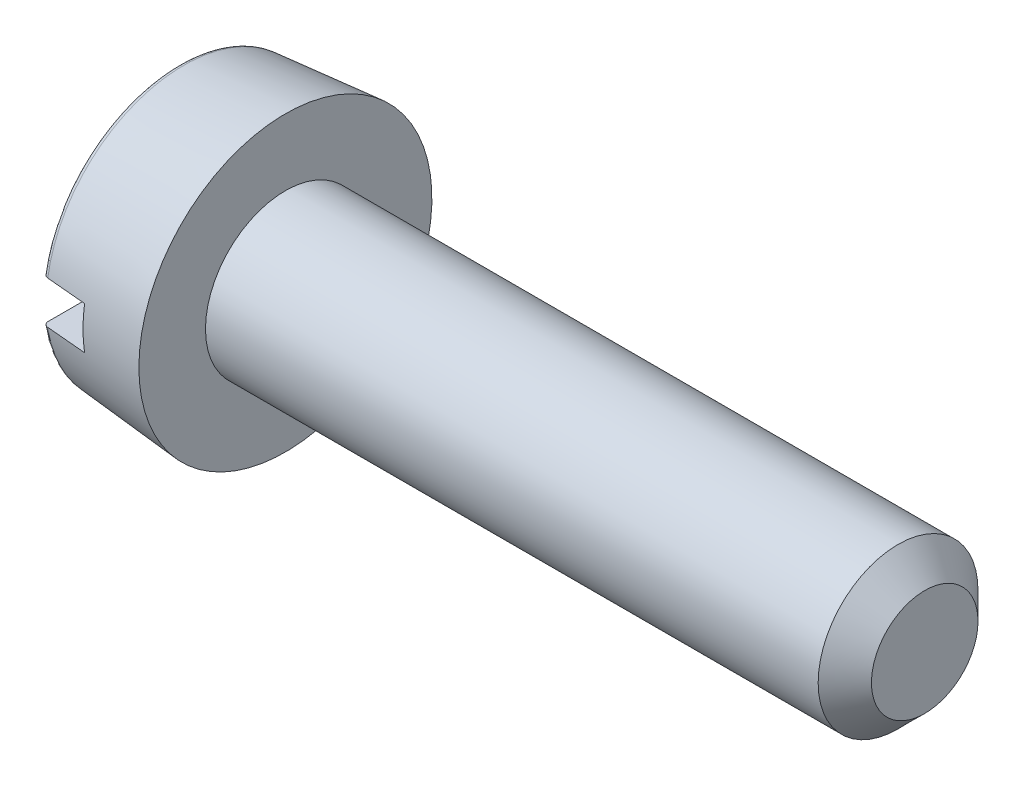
ISO-10303-21;
HEADER;
FILE_DESCRIPTION(('STEP AP214'),'2;1');
FILE_NAME('part.step','',(''),(''),'','','');
FILE_SCHEMA(('AUTOMOTIVE_DESIGN { 1 0 10303 214 1 1 1 1 }'));
ENDSEC;
DATA;
#1=APPLICATION_CONTEXT('core data for automotive mechanical design processes');
#2=APPLICATION_PROTOCOL_DEFINITION('international standard','automotive_design',2000,#1);
#3=PRODUCT_CONTEXT('',#1,'mechanical');
#4=PRODUCT('Part','Part','',(#3));
#5=PRODUCT_RELATED_PRODUCT_CATEGORY('part','',(#4));
#6=PRODUCT_DEFINITION_FORMATION('','',#4);
#7=PRODUCT_DEFINITION_CONTEXT('part definition',#1,'design');
#8=PRODUCT_DEFINITION('design','',#6,#7);
#9=PRODUCT_DEFINITION_SHAPE('','',#8);
#10=(LENGTH_UNIT() NAMED_UNIT(*) SI_UNIT(.MILLI.,.METRE.));
#11=(NAMED_UNIT(*) PLANE_ANGLE_UNIT() SI_UNIT($,.RADIAN.));
#12=(NAMED_UNIT(*) SI_UNIT($,.STERADIAN.) SOLID_ANGLE_UNIT());
#13=UNCERTAINTY_MEASURE_WITH_UNIT(LENGTH_MEASURE(1.E-05),#10,'distance_accuracy_value','');
#14=(GEOMETRIC_REPRESENTATION_CONTEXT(3) GLOBAL_UNCERTAINTY_ASSIGNED_CONTEXT((#13)) GLOBAL_UNIT_ASSIGNED_CONTEXT((#10,
#11,#12)) REPRESENTATION_CONTEXT('',''));
#15=CARTESIAN_POINT('',(0.,0.,0.));
#16=DIRECTION('',(0.,0.,1.));
#17=DIRECTION('',(1.,0.,0.));
#18=AXIS2_PLACEMENT_3D('',#15,#16,#17);
#19=CARTESIAN_POINT('',(0.,0.,0.));
#20=DIRECTION('',(-1.,0.,0.));
#21=DIRECTION('',(0.,0.,1.));
#22=AXIS2_PLACEMENT_3D('',#19,#20,#21);
#23=PLANE('',#22);
#24=DIRECTION('',(0.,0.,-1.));
#25=VECTOR('',#24,1.);
#26=CARTESIAN_POINT('',(0.,0.399999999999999,2.75));
#27=LINE('',#26,#25);
#28=CARTESIAN_POINT('',(0.,0.399999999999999,2.45096382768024));
#29=VERTEX_POINT('',#28);
#30=CARTESIAN_POINT('',(0.,0.399999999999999,-2.45096382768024));
#31=VERTEX_POINT('',#30);
#32=EDGE_CURVE('E105',#29,#31,#27,.T.);
#33=ORIENTED_EDGE('',*,*,#32,.F.);
#34=CARTESIAN_POINT('',(0.,0.,0.));
#35=DIRECTION('',(-1.,0.,0.));
#36=DIRECTION('',(0.,0.,1.));
#37=AXIS2_PLACEMENT_3D('',#34,#35,#36);
#38=CIRCLE('',#37,2.48338955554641);
#39=EDGE_CURVE('E108',#29,#31,#38,.T.);
#40=ORIENTED_EDGE('',*,*,#39,.T.);
#41=EDGE_LOOP('',(#33,#40));
#42=FACE_BOUND('',#41,.T.);
#43=ADVANCED_FACE('F37',(#42),#23,.T.);
#44=CARTESIAN_POINT('',(0.1,0.,0.));
#45=DIRECTION('',(-1.,0.,0.));
#46=DIRECTION('',(0.,0.,1.));
#47=AXIS2_PLACEMENT_3D('',#44,#45,#46);
#48=TOROIDAL_SURFACE('',#47,2.48338955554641,0.1);
#49=CARTESIAN_POINT('',(0.0485751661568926,0.399999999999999,-2.53782400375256));
#50=CARTESIAN_POINT('',(0.0533355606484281,0.399999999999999,-2.54071333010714));
#51=CARTESIAN_POINT('',(0.0583417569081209,0.399999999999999,-2.5432050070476));
#52=CARTESIAN_POINT('',(0.0687050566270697,0.399999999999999,-2.54731542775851));
#53=CARTESIAN_POINT('',(0.0740625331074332,0.399999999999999,-2.54893322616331));
#54=CARTESIAN_POINT('',(0.0849727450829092,0.399999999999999,-2.55124400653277));
#55=CARTESIAN_POINT('',(0.0905254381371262,0.399999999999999,-2.55193718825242));
#56=CARTESIAN_POINT('',(0.101666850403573,0.399999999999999,-2.55237774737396));
#57=CARTESIAN_POINT('',(0.107255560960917,0.399999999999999,-2.55212534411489));
#58=CARTESIAN_POINT('',(0.118292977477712,0.399999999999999,-2.55068537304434));
#59=CARTESIAN_POINT('',(0.123742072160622,0.399999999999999,-2.54950078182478));
#60=CARTESIAN_POINT('',(0.134364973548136,0.399999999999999,-2.54623584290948));
#61=CARTESIAN_POINT('',(0.139538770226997,0.399999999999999,-2.54415546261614));
#62=CARTESIAN_POINT('',(0.149479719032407,0.399999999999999,-2.53915450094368));
#63=CARTESIAN_POINT('',(0.1542457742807,0.399999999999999,-2.5362317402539));
#64=CARTESIAN_POINT('',(0.163225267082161,0.399999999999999,-2.52963434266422));
#65=CARTESIAN_POINT('',(0.167438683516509,0.399999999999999,-2.52595967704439));
#66=CARTESIAN_POINT('',(0.175235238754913,0.399999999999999,-2.51792797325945));
#67=CARTESIAN_POINT('',(0.178812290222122,0.399999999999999,-2.51356502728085));
#68=CARTESIAN_POINT('',(0.185193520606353,0.399999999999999,-2.50430657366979));
#69=CARTESIAN_POINT('',(0.187997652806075,0.399999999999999,-2.49941103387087));
#70=CARTESIAN_POINT('',(0.192789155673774,0.399999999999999,-2.48916309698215));
#71=CARTESIAN_POINT('',(0.194766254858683,0.399999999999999,-2.48380589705));
#72=CARTESIAN_POINT('',(0.197803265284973,0.399999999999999,-2.47283752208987));
#73=CARTESIAN_POINT('',(0.198863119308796,0.399999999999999,-2.46722633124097));
#74=CARTESIAN_POINT('',(0.200044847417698,0.399999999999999,-2.45584788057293));
#75=CARTESIAN_POINT('',(0.200157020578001,0.399999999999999,-2.45007961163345));
#76=CARTESIAN_POINT('',(0.199415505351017,0.399999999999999,-2.43860536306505));
#77=CARTESIAN_POINT('',(0.198561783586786,0.399999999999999,-2.43289938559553));
#78=CARTESIAN_POINT('',(0.195905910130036,0.399999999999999,-2.42168897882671));
#79=CARTESIAN_POINT('',(0.194100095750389,0.399999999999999,-2.41618541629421));
#80=CARTESIAN_POINT('',(0.189585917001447,0.399999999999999,-2.40556157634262));
#81=CARTESIAN_POINT('',(0.186877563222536,0.399999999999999,-2.40044129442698));
#82=CARTESIAN_POINT('',(0.180646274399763,0.399999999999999,-2.39075689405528));
#83=CARTESIAN_POINT('',(0.177127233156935,0.399999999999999,-2.38619027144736));
#84=CARTESIAN_POINT('',(0.16936410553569,0.399999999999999,-2.37772142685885));
#85=CARTESIAN_POINT('',(0.165120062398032,0.399999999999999,-2.37381916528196));
#86=CARTESIAN_POINT('',(0.15607995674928,0.399999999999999,-2.36683969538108));
#87=CARTESIAN_POINT('',(0.151290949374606,0.399999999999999,-2.36375335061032));
#88=CARTESIAN_POINT('',(0.14125723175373,0.399999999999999,-2.35844131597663));
#89=CARTESIAN_POINT('',(0.136012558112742,0.399999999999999,-2.35621555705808));
#90=CARTESIAN_POINT('',(0.125292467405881,0.399999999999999,-2.35271848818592));
#91=CARTESIAN_POINT('',(0.119821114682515,0.399999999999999,-2.35143471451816));
#92=CARTESIAN_POINT('',(0.10874007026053,0.399999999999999,-2.3498129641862));
#93=CARTESIAN_POINT('',(0.103130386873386,0.399999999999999,-2.34947493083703));
#94=CARTESIAN_POINT('',(0.0919839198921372,0.399999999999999,-2.34975394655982));
#95=CARTESIAN_POINT('',(0.0864469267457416,0.399999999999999,-2.3503627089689));
#96=CARTESIAN_POINT('',(0.0755538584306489,0.399999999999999,-2.35250103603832));
#97=CARTESIAN_POINT('',(0.0701977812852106,0.399999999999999,-2.35403059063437));
#98=CARTESIAN_POINT('',(0.0598152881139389,0.399999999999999,-2.35796437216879));
#99=CARTESIAN_POINT('',(0.0547889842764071,0.399999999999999,-2.36036889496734));
#100=CARTESIAN_POINT('',(0.0452064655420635,0.399999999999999,-2.36598034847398));
#101=CARTESIAN_POINT('',(0.040650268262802,0.399999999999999,-2.36918730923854));
#102=CARTESIAN_POINT('',(0.032091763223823,0.399999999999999,-2.37634229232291));
#103=CARTESIAN_POINT('',(0.0280948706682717,0.399999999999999,-2.38029679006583));
#104=CARTESIAN_POINT('',(0.0208109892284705,0.399999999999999,-2.3888128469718));
#105=CARTESIAN_POINT('',(0.0175240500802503,0.399999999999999,-2.39337444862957));
#106=CARTESIAN_POINT('',(0.0117067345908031,0.399999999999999,-2.4030406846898));
#107=CARTESIAN_POINT('',(0.00918709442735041,0.399999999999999,-2.40815178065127));
#108=CARTESIAN_POINT('',(0.00503040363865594,0.399999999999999,-2.41872109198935));
#109=CARTESIAN_POINT('',(0.00339341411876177,0.399999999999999,-2.42417933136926));
#110=CARTESIAN_POINT('',(0.00103079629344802,0.399999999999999,-2.43535569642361));
#111=CARTESIAN_POINT('',(0.000315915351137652,0.399999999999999,-2.44107609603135));
#112=CARTESIAN_POINT('',(-0.000148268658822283,0.399999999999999,-2.45255584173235));
#113=CARTESIAN_POINT('',(0.00010242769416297,0.399999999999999,-2.45831518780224));
#114=CARTESIAN_POINT('',(0.00156672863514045,0.399999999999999,-2.46973701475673));
#115=CARTESIAN_POINT('',(0.00278471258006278,0.399999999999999,-2.47539893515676));
#116=CARTESIAN_POINT('',(0.0061580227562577,0.399999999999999,-2.48643816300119));
#117=CARTESIAN_POINT('',(0.00831357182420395,0.399999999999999,-2.49181540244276));
#118=CARTESIAN_POINT('',(0.0134950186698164,0.399999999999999,-2.50210927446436));
#119=CARTESIAN_POINT('',(0.0165179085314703,0.399999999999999,-2.5070274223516));
#120=CARTESIAN_POINT('',(0.023352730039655,0.399999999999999,-2.51627478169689));
#121=CARTESIAN_POINT('',(0.0271636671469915,0.399999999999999,-2.52060472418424));
#122=CARTESIAN_POINT('',(0.0339390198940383,0.399999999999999,-2.52708853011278));
#123=CARTESIAN_POINT('',(0.0367007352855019,0.399999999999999,-2.52945777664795));
#124=CARTESIAN_POINT('',(0.04246511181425,0.399999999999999,-2.5338824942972));
#125=CARTESIAN_POINT('',(0.0454677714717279,0.399999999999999,-2.53593796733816));
#126=CARTESIAN_POINT('',(0.0485751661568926,0.399999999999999,-2.53782400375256));
#127=B_SPLINE_CURVE_WITH_KNOTS('',3,(#49,#50,#51,#52,#53,#54,#55,#56,#57,#58,#59,#60,#61,#62,
#63,#64,#65,#66,#67,#68,#69,#70,#71,#72,#73,#74,#75,#76,#77,#78,#79,#80,#81,#82,#83,#84,#85,#86,
#87,#88,#89,#90,#91,#92,#93,#94,#95,#96,#97,#98,#99,#100,#101,#102,#103,#104,#105,#106,#107,
#108,#109,#110,#111,#112,#113,#114,#115,#116,#117,#118,#119,#120,#121,#122,#123,#124,#125,#126),
.UNSPECIFIED.,.T.,.F.,(4,2,2,2,2,2,2,2,2,2,2,2,2,2,2,2,2,2,2,2,2,2,2,2,2,2,2,2,2,2,2,2,2,2,2,2,
2,2,4),(0.,0.0166927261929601,0.0334034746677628,0.0501106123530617,0.0668138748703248,
0.0834640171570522,0.100114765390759,0.116808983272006,0.133503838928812,0.150350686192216,
0.167198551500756,0.184249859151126,0.201302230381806,0.21852894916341,0.235756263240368,
0.253050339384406,0.270344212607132,0.287556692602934,0.304768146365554,0.321777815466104,
0.338786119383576,0.355565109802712,0.372343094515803,0.388975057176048,0.405606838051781,
0.422244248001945,0.438882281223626,0.455671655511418,0.472462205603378,0.489477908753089,
0.506494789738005,0.523708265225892,0.54092173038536,0.558213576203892,0.575509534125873,
0.592746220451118,0.609961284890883,0.620857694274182,0.631754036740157),.UNSPECIFIED.);
#128=CARTESIAN_POINT('',(0.0912844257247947,0.399999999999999,-2.55184945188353));
#129=VERTEX_POINT('',#128);
#130=EDGE_CURVE('E60',#31,#129,#127,.T.);
#131=ORIENTED_EDGE('',*,*,#130,.F.);
#132=ORIENTED_EDGE('',*,*,#39,.F.);
#133=CARTESIAN_POINT('',(0.066087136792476,0.399999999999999,2.35559521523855));
#134=CARTESIAN_POINT('',(0.0712950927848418,0.399999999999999,2.35369117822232));
#135=CARTESIAN_POINT('',(0.076666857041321,0.399999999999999,2.35222401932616));
#136=CARTESIAN_POINT('',(0.0875846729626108,0.399999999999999,2.35021144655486));
#137=CARTESIAN_POINT('',(0.0931309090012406,0.399999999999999,2.34966704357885));
#138=CARTESIAN_POINT('',(0.104234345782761,0.399999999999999,2.34951890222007));
#139=CARTESIAN_POINT('',(0.109791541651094,0.399999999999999,2.34991481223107));
#140=CARTESIAN_POINT('',(0.120758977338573,0.399999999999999,2.35163438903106));
#141=CARTESIAN_POINT('',(0.126169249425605,0.399999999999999,2.3529578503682));
#142=CARTESIAN_POINT('',(0.136691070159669,0.399999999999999,2.35649136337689));
#143=CARTESIAN_POINT('',(0.141802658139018,0.399999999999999,2.35870129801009));
#144=CARTESIAN_POINT('',(0.151586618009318,0.399999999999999,2.36394124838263));
#145=CARTESIAN_POINT('',(0.15625896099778,0.399999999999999,2.36697131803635));
#146=CARTESIAN_POINT('',(0.165074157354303,0.399999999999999,2.37379047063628));
#147=CARTESIAN_POINT('',(0.169212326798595,0.399999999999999,2.37758560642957));
#148=CARTESIAN_POINT('',(0.176803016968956,0.399999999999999,2.38580863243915));
#149=CARTESIAN_POINT('',(0.180255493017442,0.399999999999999,2.39023656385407));
#150=CARTESIAN_POINT('',(0.186425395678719,0.399999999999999,2.39966205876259));
#151=CARTESIAN_POINT('',(0.189132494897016,0.399999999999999,2.40466638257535));
#152=CARTESIAN_POINT('',(0.19367967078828,0.399999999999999,2.41505452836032));
#153=CARTESIAN_POINT('',(0.195519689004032,0.399999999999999,2.42043837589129));
#154=CARTESIAN_POINT('',(0.19830186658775,0.399999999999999,2.43150243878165));
#155=CARTESIAN_POINT('',(0.199232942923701,0.399999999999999,2.43718544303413));
#156=CARTESIAN_POINT('',(0.200133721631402,0.399999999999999,2.44862724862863));
#157=CARTESIAN_POINT('',(0.200103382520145,0.399999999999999,2.45438605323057));
#158=CARTESIAN_POINT('',(0.199078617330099,0.399999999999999,2.46584997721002));
#159=CARTESIAN_POINT('',(0.198078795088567,0.399999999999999,2.47155461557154));
#160=CARTESIAN_POINT('',(0.195132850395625,0.399999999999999,2.48271426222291));
#161=CARTESIAN_POINT('',(0.193186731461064,0.399999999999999,2.4881692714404));
#162=CARTESIAN_POINT('',(0.188406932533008,0.399999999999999,2.49865615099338));
#163=CARTESIAN_POINT('',(0.185575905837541,0.399999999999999,2.50368922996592));
#164=CARTESIAN_POINT('',(0.179101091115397,0.399999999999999,2.51320240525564));
#165=CARTESIAN_POINT('',(0.17545734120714,0.399999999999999,2.51768252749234));
#166=CARTESIAN_POINT('',(0.167497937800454,0.399999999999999,2.52591455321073));
#167=CARTESIAN_POINT('',(0.163189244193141,0.399999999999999,2.52967318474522));
#168=CARTESIAN_POINT('',(0.153995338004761,0.399999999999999,2.53640297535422));
#169=CARTESIAN_POINT('',(0.149110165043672,0.399999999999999,2.53937418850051));
#170=CARTESIAN_POINT('',(0.138966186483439,0.399999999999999,2.54440671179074));
#171=CARTESIAN_POINT('',(0.133712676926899,0.399999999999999,2.54647869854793));
#172=CARTESIAN_POINT('',(0.122930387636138,0.399999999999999,2.54970170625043));
#173=CARTESIAN_POINT('',(0.117401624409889,0.399999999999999,2.55085278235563));
#174=CARTESIAN_POINT('',(0.106281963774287,0.399999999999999,2.55219206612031));
#175=CARTESIAN_POINT('',(0.100692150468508,0.399999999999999,2.55238928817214));
#176=CARTESIAN_POINT('',(0.0895592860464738,0.399999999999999,2.55183933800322));
#177=CARTESIAN_POINT('',(0.0840162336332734,0.399999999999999,2.55109219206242));
#178=CARTESIAN_POINT('',(0.0731512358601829,0.399999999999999,2.5486799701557));
#179=CARTESIAN_POINT('',(0.0678286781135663,0.399999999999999,2.54701764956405));
#180=CARTESIAN_POINT('',(0.0575363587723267,0.399999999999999,2.54282694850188));
#181=CARTESIAN_POINT('',(0.0525666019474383,0.399999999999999,2.54029855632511));
#182=CARTESIAN_POINT('',(0.0430955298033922,0.399999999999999,2.53443716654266));
#183=CARTESIAN_POINT('',(0.03859644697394,0.399999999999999,2.53110056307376));
#184=CARTESIAN_POINT('',(0.0302151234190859,0.399999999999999,2.52372648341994));
#185=CARTESIAN_POINT('',(0.0263329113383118,0.399999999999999,2.51968897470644));
#186=CARTESIAN_POINT('',(0.0192521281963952,0.399999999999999,2.51098384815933));
#187=CARTESIAN_POINT('',(0.0160610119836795,0.399999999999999,2.5063101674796));
#188=CARTESIAN_POINT('',(0.0104977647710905,0.399999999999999,2.49649850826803));
#189=CARTESIAN_POINT('',(0.0081256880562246,0.399999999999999,2.49136049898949));
#190=CARTESIAN_POINT('',(0.00423822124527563,0.399999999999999,2.48069955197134));
#191=CARTESIAN_POINT('',(0.00273352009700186,0.399999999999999,2.4751727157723));
#192=CARTESIAN_POINT('',(0.000664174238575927,0.399999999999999,2.4639457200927));
#193=CARTESIAN_POINT('',(9.95845082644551E-05,0.399999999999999,2.45824555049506));
#194=CARTESIAN_POINT('',(-7.62295306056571E-05,0.399999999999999,2.4467793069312));
#195=CARTESIAN_POINT('',(0.000321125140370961,0.399999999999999,2.44101309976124));
#196=CARTESIAN_POINT('',(0.00207635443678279,0.399999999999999,2.42962883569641));
#197=CARTESIAN_POINT('',(0.00343421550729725,0.399999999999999,2.424010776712));
#198=CARTESIAN_POINT('',(0.00707734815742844,0.399999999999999,2.41307368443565));
#199=CARTESIAN_POINT('',(0.00936409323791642,0.399999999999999,2.4077551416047));
#200=CARTESIAN_POINT('',(0.014804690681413,0.399999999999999,2.39757966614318));
#201=CARTESIAN_POINT('',(0.0179587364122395,0.399999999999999,2.39272283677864));
#202=CARTESIAN_POINT('',(0.0250240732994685,0.399999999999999,2.38364579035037));
#203=CARTESIAN_POINT('',(0.0289303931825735,0.399999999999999,2.37942170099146));
#204=CARTESIAN_POINT('',(0.0374021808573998,0.399999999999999,2.3717039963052));
#205=CARTESIAN_POINT('',(0.0419667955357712,0.399999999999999,2.36820944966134));
#206=CARTESIAN_POINT('',(0.0498248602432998,0.399999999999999,2.3632007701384));
#207=CARTESIAN_POINT('',(0.0529598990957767,0.399999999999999,2.36143340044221));
#208=CARTESIAN_POINT('',(0.0594027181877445,0.399999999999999,2.35824787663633));
#209=CARTESIAN_POINT('',(0.062710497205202,0.399999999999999,2.35682972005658));
#210=CARTESIAN_POINT('',(0.066087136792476,0.399999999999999,2.35559521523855));
#211=B_SPLINE_CURVE_WITH_KNOTS('',3,(#133,#134,#135,#136,#137,#138,#139,#140,#141,#142,#143,
#144,#145,#146,#147,#148,#149,#150,#151,#152,#153,#154,#155,#156,#157,#158,#159,#160,#161,#162,
#163,#164,#165,#166,#167,#168,#169,#170,#171,#172,#173,#174,#175,#176,#177,#178,#179,#180,#181,
#182,#183,#184,#185,#186,#187,#188,#189,#190,#191,#192,#193,#194,#195,#196,#197,#198,#199,#200,
#201,#202,#203,#204,#205,#206,#207,#208,#209,#210),.UNSPECIFIED.,.T.,.F.,(4,2,2,2,2,2,2,2,2,2,2,
2,2,2,2,2,2,2,2,2,2,2,2,2,2,2,2,2,2,2,2,2,2,2,2,2,2,2,4),(0.,0.0166222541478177,
0.0332627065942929,0.0498969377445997,0.0665274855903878,0.0831558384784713,0.0997852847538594,
0.116551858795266,0.133319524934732,0.150308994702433,0.16729960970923,0.184494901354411,
0.201690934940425,0.218983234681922,0.236275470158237,0.253516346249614,0.270756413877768,
0.287826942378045,0.304896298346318,0.321757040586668,0.338616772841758,0.355316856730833,
0.372016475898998,0.388666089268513,0.405315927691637,0.422041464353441,0.438767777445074,
0.455666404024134,0.472566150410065,0.489669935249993,0.506774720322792,0.524032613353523,
0.541290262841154,0.558575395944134,0.575864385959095,0.593042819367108,0.610199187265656,
0.620976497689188,0.631753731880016),.UNSPECIFIED.);
#212=CARTESIAN_POINT('',(0.0912844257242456,0.399999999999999,2.55184945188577));
#213=VERTEX_POINT('',#212);
#214=EDGE_CURVE('E97',#213,#29,#211,.T.);
#215=ORIENTED_EDGE('',*,*,#214,.F.);
#216=CARTESIAN_POINT('',(0.0912844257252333,0.,0.));
#217=DIRECTION('',(-1.,0.,0.));
#218=DIRECTION('',(0.,0.,1.));
#219=AXIS2_PLACEMENT_3D('',#216,#217,#218);
#220=CIRCLE('',#219,2.58300902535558);
#221=EDGE_CURVE('E112',#129,#213,#220,.F.);
#222=ORIENTED_EDGE('',*,*,#221,.F.);
#223=EDGE_LOOP('',(#131,#132,#215,#222));
#224=FACE_BOUND('',#223,.T.);
#225=ADVANCED_FACE('F178',(#224),#48,.T.);
#226=CARTESIAN_POINT('',(-25.4,0.,0.));
#227=DIRECTION('',(-1.,0.,0.));
#228=DIRECTION('',(0.,0.,1.));
#229=AXIS2_PLACEMENT_3D('',#226,#227,#228);
#230=CYLINDRICAL_SURFACE('',#229,1.5);
#231=CARTESIAN_POINT('',(13.5,0.,0.));
#232=DIRECTION('',(1.,0.,0.));
#233=DIRECTION('',(0.,0.,-1.));
#234=AXIS2_PLACEMENT_3D('',#231,#232,#233);
#235=CIRCLE('',#234,1.5);
#236=CARTESIAN_POINT('',(13.5,0.,-1.5));
#237=VERTEX_POINT('',#236);
#238=EDGE_CURVE('E45',#237,#237,#235,.F.);
#239=ORIENTED_EDGE('',*,*,#238,.T.);
#240=EDGE_LOOP('',(#239));
#241=FACE_BOUND('',#240,.T.);
#242=CARTESIAN_POINT('',(2.,0.,0.));
#243=DIRECTION('',(-1.,0.,0.));
#244=DIRECTION('',(0.,0.,1.));
#245=AXIS2_PLACEMENT_3D('',#242,#243,#244);
#246=CIRCLE('',#245,1.5);
#247=CARTESIAN_POINT('',(2.,0.,1.5));
#248=VERTEX_POINT('',#247);
#249=EDGE_CURVE('E114',#248,#248,#246,.T.);
#250=ORIENTED_EDGE('',*,*,#249,.F.);
#251=EDGE_LOOP('',(#250));
#252=FACE_BOUND('',#251,.T.);
#253=ADVANCED_FACE('F39',(#241,#252),#230,.T.);
#254=CARTESIAN_POINT('',(14.,1.5,0.));
#255=DIRECTION('',(1.,0.,0.));
#256=DIRECTION('',(0.,0.,-1.));
#257=AXIS2_PLACEMENT_3D('',#254,#255,#256);
#258=PLANE('',#257);
#259=CARTESIAN_POINT('',(14.,0.,0.));
#260=DIRECTION('',(1.,0.,0.));
#261=DIRECTION('',(0.,0.,-1.));
#262=AXIS2_PLACEMENT_3D('',#259,#260,#261);
#263=CIRCLE('',#262,1.);
#264=CARTESIAN_POINT('',(14.,0.,-1.));
#265=VERTEX_POINT('',#264);
#266=EDGE_CURVE('E11',#265,#265,#263,.T.);
#267=ORIENTED_EDGE('',*,*,#266,.T.);
#268=EDGE_LOOP('',(#267));
#269=FACE_BOUND('',#268,.T.);
#270=ADVANCED_FACE('F177',(#269),#258,.T.);
#271=DIRECTION('',(0.,0.,1.));
#272=VECTOR('',#271,1.);
#273=CARTESIAN_POINT('',(0.,-0.4,-2.75));
#274=LINE('',#273,#272);
#275=CARTESIAN_POINT('',(0.,-0.4,-2.45096382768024));
#276=VERTEX_POINT('',#275);
#277=CARTESIAN_POINT('',(0.,-0.4,2.45096382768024));
#278=VERTEX_POINT('',#277);
#279=EDGE_CURVE('E52',#276,#278,#274,.T.);
#280=ORIENTED_EDGE('',*,*,#279,.F.);
#281=EDGE_CURVE('E103',#276,#278,#38,.T.);
#282=ORIENTED_EDGE('',*,*,#281,.T.);
#283=EDGE_LOOP('',(#280,#282));
#284=FACE_BOUND('',#283,.T.);
#285=ADVANCED_FACE('F102',(#284),#23,.T.);
#286=CARTESIAN_POINT('',(0.,0.,0.));
#287=DIRECTION('',(1.,0.,0.));
#288=DIRECTION('',(0.,0.,-1.));
#289=AXIS2_PLACEMENT_3D('',#286,#287,#288);
#290=CONICAL_SURFACE('',#289,2.57502267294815,0.0872664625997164);
#291=CARTESIAN_POINT('',(5.21123588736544,0.399999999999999,3.00443640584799));
#292=CARTESIAN_POINT('',(4.41342358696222,0.399999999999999,2.93401988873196));
#293=CARTESIAN_POINT('',(3.61561486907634,0.399999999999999,2.86356274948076));
#294=CARTESIAN_POINT('',(2.02000692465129,0.399999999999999,2.72254136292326));
#295=CARTESIAN_POINT('',(1.22220769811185,0.399999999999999,2.65197711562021));
#296=CARTESIAN_POINT('',(-0.373378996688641,0.399999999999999,2.51071564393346));
#297=CARTESIAN_POINT('',(-1.17116646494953,0.399999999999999,2.44001841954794));
#298=CARTESIAN_POINT('',(-2.76672581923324,0.399999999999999,2.298448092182));
#299=CARTESIAN_POINT('',(-3.56449770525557,0.399999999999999,2.22757498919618));
#300=CARTESIAN_POINT('',(-4.36225986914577,0.399999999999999,2.15659249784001));
#301=B_SPLINE_CURVE_WITH_KNOTS('',3,(#291,#292,#293,#294,#295,#296,#297,#298,#299,#300),
.UNSPECIFIED.,.F.,.F.,(4,2,2,2,4),(0.,2.40274147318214,4.80548287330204,7.20822430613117,
9.6109658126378),.UNSPECIFIED.);
#302=CARTESIAN_POINT('',(0.85,0.399999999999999,2.61901832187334));
#303=VERTEX_POINT('',#302);
#304=EDGE_CURVE('E164',#303,#213,#301,.T.);
#305=ORIENTED_EDGE('',*,*,#304,.F.);
#306=CARTESIAN_POINT('',(0.85,0.,0.));
#307=DIRECTION('',(1.,0.,0.));
#308=DIRECTION('',(0.,0.,-1.));
#309=AXIS2_PLACEMENT_3D('',#306,#307,#308);
#310=CIRCLE('',#309,2.64938803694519);
#311=CARTESIAN_POINT('',(0.85,-0.4,2.61901832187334));
#312=VERTEX_POINT('',#311);
#313=EDGE_CURVE('E275',#312,#303,#310,.F.);
#314=ORIENTED_EDGE('',*,*,#313,.F.);
#315=CARTESIAN_POINT('',(-4.36225986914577,-0.4,2.15659249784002));
#316=CARTESIAN_POINT('',(-3.02252879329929,-0.4,2.27578971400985));
#317=CARTESIAN_POINT('',(-1.68277158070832,-0.4,2.3946924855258));
#318=CARTESIAN_POINT('',(-0.0871929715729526,-0.4,2.5360455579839));
#319=CARTESIAN_POINT('',(0.168610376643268,-0.4,2.55869953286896));
#320=CARTESIAN_POINT('',(2.02000114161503,-0.4,2.72260692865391));
#321=CARTESIAN_POINT('',(3.61561248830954,-0.4,2.86359016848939));
#322=CARTESIAN_POINT('',(5.21123588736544,-0.4,3.00443640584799));
#323=B_SPLINE_CURVE_WITH_KNOTS('',3,(#315,#316,#317,#318,#319,#320,#321,#322),.UNSPECIFIED.,.F.,
.F.,(4,2,2,4),(0.,4.03506939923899,4.80548292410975,9.61096578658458),.UNSPECIFIED.);
#324=CARTESIAN_POINT('',(0.0912844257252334,-0.4,2.5518494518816));
#325=VERTEX_POINT('',#324);
#326=EDGE_CURVE('E142',#325,#312,#323,.T.);
#327=ORIENTED_EDGE('',*,*,#326,.F.);
#328=CARTESIAN_POINT('',(0.0912844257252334,-0.4,-2.55184945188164));
#329=VERTEX_POINT('',#328);
#330=EDGE_CURVE('E118',#325,#329,#220,.F.);
#331=ORIENTED_EDGE('',*,*,#330,.T.);
#332=CARTESIAN_POINT('',(5.21123588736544,-0.4,-3.00443640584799));
#333=CARTESIAN_POINT('',(4.41342358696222,-0.4,-2.93401988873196));
#334=CARTESIAN_POINT('',(3.61561486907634,-0.4,-2.86356274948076));
#335=CARTESIAN_POINT('',(2.02000692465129,-0.4,-2.72254136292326));
#336=CARTESIAN_POINT('',(1.22220769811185,-0.4,-2.65197711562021));
#337=CARTESIAN_POINT('',(-0.373378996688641,-0.4,-2.51071564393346));
#338=CARTESIAN_POINT('',(-1.17116646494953,-0.4,-2.44001841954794));
#339=CARTESIAN_POINT('',(-2.76672581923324,-0.4,-2.298448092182));
#340=CARTESIAN_POINT('',(-3.56449770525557,-0.4,-2.22757498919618));
#341=CARTESIAN_POINT('',(-4.36225986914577,-0.4,-2.15659249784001));
#342=B_SPLINE_CURVE_WITH_KNOTS('',3,(#332,#333,#334,#335,#336,#337,#338,#339,#340,#341),
.UNSPECIFIED.,.F.,.F.,(4,2,2,2,4),(0.,2.40274147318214,4.80548287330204,7.20822430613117,
9.6109658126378),.UNSPECIFIED.);
#343=CARTESIAN_POINT('',(0.85,-0.4,-2.61901832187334));
#344=VERTEX_POINT('',#343);
#345=EDGE_CURVE('E92',#344,#329,#342,.T.);
#346=ORIENTED_EDGE('',*,*,#345,.F.);
#347=CARTESIAN_POINT('',(0.85,0.399999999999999,-2.61901832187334));
#348=VERTEX_POINT('',#347);
#349=EDGE_CURVE('E276',#348,#344,#310,.F.);
#350=ORIENTED_EDGE('',*,*,#349,.F.);
#351=CARTESIAN_POINT('',(-4.36225986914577,0.399999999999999,-2.15659249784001));
#352=CARTESIAN_POINT('',(-3.02252879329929,0.399999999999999,-2.27578971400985));
#353=CARTESIAN_POINT('',(-1.68277158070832,0.399999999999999,-2.3946924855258));
#354=CARTESIAN_POINT('',(-0.0871929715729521,0.399999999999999,-2.5360455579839));
#355=CARTESIAN_POINT('',(0.168610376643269,0.399999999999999,-2.55869953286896));
#356=CARTESIAN_POINT('',(2.02000114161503,0.399999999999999,-2.72260692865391));
#357=CARTESIAN_POINT('',(3.61561248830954,0.399999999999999,-2.86359016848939));
#358=CARTESIAN_POINT('',(5.21123588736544,0.399999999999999,-3.00443640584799));
#359=B_SPLINE_CURVE_WITH_KNOTS('',3,(#351,#352,#353,#354,#355,#356,#357,#358),.UNSPECIFIED.,.F.,
.F.,(4,2,2,4),(0.,4.03506939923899,4.80548292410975,9.61096578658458),.UNSPECIFIED.);
#360=EDGE_CURVE('E168',#129,#348,#359,.T.);
#361=ORIENTED_EDGE('',*,*,#360,.F.);
#362=ORIENTED_EDGE('',*,*,#221,.T.);
#363=EDGE_LOOP('',(#305,#314,#327,#331,#346,#350,#361,#362));
#364=FACE_BOUND('',#363,.T.);
#365=CARTESIAN_POINT('',(2.,0.,0.));
#366=DIRECTION('',(-1.,0.,0.));
#367=DIRECTION('',(0.,0.,1.));
#368=AXIS2_PLACEMENT_3D('',#365,#366,#367);
#369=CIRCLE('',#368,2.75);
#370=CARTESIAN_POINT('',(2.,0.,2.75));
#371=VERTEX_POINT('',#370);
#372=EDGE_CURVE('E109',#371,#371,#369,.T.);
#373=ORIENTED_EDGE('',*,*,#372,.T.);
#374=EDGE_LOOP('',(#373));
#375=FACE_BOUND('',#374,.T.);
#376=ADVANCED_FACE('F154',(#364,#375),#290,.T.);
#377=CARTESIAN_POINT('',(2.,1.5,0.));
#378=DIRECTION('',(-1.,0.,0.));
#379=DIRECTION('',(0.,0.,1.));
#380=AXIS2_PLACEMENT_3D('',#377,#378,#379);
#381=PLANE('',#380);
#382=ORIENTED_EDGE('',*,*,#372,.F.);
#383=EDGE_LOOP('',(#382));
#384=FACE_BOUND('',#383,.T.);
#385=ORIENTED_EDGE('',*,*,#249,.T.);
#386=EDGE_LOOP('',(#385));
#387=FACE_BOUND('',#386,.T.);
#388=ADVANCED_FACE('F158',(#384,#387),#381,.F.);
#389=CARTESIAN_POINT('',(0.0485751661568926,-0.4,-2.53782400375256));
#390=CARTESIAN_POINT('',(0.0437427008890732,-0.4,-2.53489033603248));
#391=CARTESIAN_POINT('',(0.0391565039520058,-0.4,-2.53154249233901));
#392=CARTESIAN_POINT('',(0.0306096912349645,-0.4,-2.52411912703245));
#393=CARTESIAN_POINT('',(0.0266499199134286,-0.4,-2.52004263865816));
#394=CARTESIAN_POINT('',(0.019472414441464,-0.4,-2.51128827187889));
#395=CARTESIAN_POINT('',(0.0162539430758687,-0.4,-2.5066109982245));
#396=CARTESIAN_POINT('',(0.010640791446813,-0.4,-2.49678789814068));
#397=CARTESIAN_POINT('',(0.0082459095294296,-0.4,-2.4916421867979));
#398=CARTESIAN_POINT('',(0.00432284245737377,-0.4,-2.48097764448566));
#399=CARTESIAN_POINT('',(0.00280265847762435,-0.4,-2.47545587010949));
#400=CARTESIAN_POINT('',(0.000701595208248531,-0.4,-2.46423612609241));
#401=CARTESIAN_POINT('',(0.000120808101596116,-0.4,-2.45853813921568));
#402=CARTESIAN_POINT('',(-8.77639340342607E-05,-0.4,-2.44707338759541));
#403=CARTESIAN_POINT('',(0.00029305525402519,-0.4,-2.44130646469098));
#404=CARTESIAN_POINT('',(0.00201549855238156,-0.4,-2.42991778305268));
#405=CARTESIAN_POINT('',(0.00335714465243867,-0.4,-2.42429602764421));
#406=CARTESIAN_POINT('',(0.00696895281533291,-0.4,-2.41334782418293));
#407=CARTESIAN_POINT('',(0.0092407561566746,-0.4,-2.40802191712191));
#408=CARTESIAN_POINT('',(0.0146521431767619,-0.4,-2.39783066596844));
#409=CARTESIAN_POINT('',(0.0177917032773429,-0.4,-2.39296530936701));
#410=CARTESIAN_POINT('',(0.0248287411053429,-0.4,-2.38387042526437));
#411=CARTESIAN_POINT('',(0.0287209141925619,-0.4,-2.37963679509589));
#412=CARTESIAN_POINT('',(0.0371689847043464,-0.4,-2.37189344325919));
#413=CARTESIAN_POINT('',(0.0417248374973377,-0.4,-2.36838367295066));
#414=CARTESIAN_POINT('',(0.0513088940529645,-0.4,-2.36223607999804));
#415=CARTESIAN_POINT('',(0.0563303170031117,-0.4,-2.35958768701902));
#416=CARTESIAN_POINT('',(0.0667506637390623,-0.4,-2.35518417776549));
#417=CARTESIAN_POINT('',(0.0721495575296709,-0.4,-2.35342899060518));
#418=CARTESIAN_POINT('',(0.0830969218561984,-0.4,-2.35088371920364));
#419=CARTESIAN_POINT('',(0.08864257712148,-0.4,-2.35008151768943));
#420=CARTESIAN_POINT('',(0.0997895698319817,-0.4,-2.34942645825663));
#421=CARTESIAN_POINT('',(0.105390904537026,-0.4,-2.34957355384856));
#422=CARTESIAN_POINT('',(0.116450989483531,-0.4,-2.35080823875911));
#423=CARTESIAN_POINT('',(0.121910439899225,-0.4,-2.35188957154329));
#424=CARTESIAN_POINT('',(0.132571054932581,-0.4,-2.35495102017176));
#425=CARTESIAN_POINT('',(0.137772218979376,-0.4,-2.35693113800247));
#426=CARTESIAN_POINT('',(0.147785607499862,-0.4,-2.36173694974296));
#427=CARTESIAN_POINT('',(0.152596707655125,-0.4,-2.36456498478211));
#428=CARTESIAN_POINT('',(0.161682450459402,-0.4,-2.37098051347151));
#429=CARTESIAN_POINT('',(0.165957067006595,-0.4,-2.3745680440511));
#430=CARTESIAN_POINT('',(0.173898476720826,-0.4,-2.38244089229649));
#431=CARTESIAN_POINT('',(0.177558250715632,-0.4,-2.38673328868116));
#432=CARTESIAN_POINT('',(0.184116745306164,-0.4,-2.39586460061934));
#433=CARTESIAN_POINT('',(0.187015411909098,-0.4,-2.40070355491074));
#434=CARTESIAN_POINT('',(0.192010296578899,-0.4,-2.41086084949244));
#435=CARTESIAN_POINT('',(0.194095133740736,-0.4,-2.41618478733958));
#436=CARTESIAN_POINT('',(0.197351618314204,-0.4,-2.42710502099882));
#437=CARTESIAN_POINT('',(0.198523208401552,-0.4,-2.43270133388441));
#438=CARTESIAN_POINT('',(0.199929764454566,-0.4,-2.44406834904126));
#439=CARTESIAN_POINT('',(0.200155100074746,-0.4,-2.4498402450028));
#440=CARTESIAN_POINT('',(0.199636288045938,-0.4,-2.4613404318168));
#441=CARTESIAN_POINT('',(0.198892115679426,-0.4,-2.46706872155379));
#442=CARTESIAN_POINT('',(0.196450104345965,-0.4,-2.47833342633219));
#443=CARTESIAN_POINT('',(0.19474990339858,-0.4,-2.48386932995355));
#444=CARTESIAN_POINT('',(0.190438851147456,-0.4,-2.49457461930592));
#445=CARTESIAN_POINT('',(0.18782801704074,-0.4,-2.49974401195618));
#446=CARTESIAN_POINT('',(0.181784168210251,-0.4,-2.50953562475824));
#447=CARTESIAN_POINT('',(0.178356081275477,-0.4,-2.51416088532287));
#448=CARTESIAN_POINT('',(0.170763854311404,-0.4,-2.52276187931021));
#449=CARTESIAN_POINT('',(0.166599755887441,-0.4,-2.52673764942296));
#450=CARTESIAN_POINT('',(0.157703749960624,-0.4,-2.53387831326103));
#451=CARTESIAN_POINT('',(0.152978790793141,-0.4,-2.53705186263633));
#452=CARTESIAN_POINT('',(0.143058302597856,-0.4,-2.54254944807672));
#453=CARTESIAN_POINT('',(0.137862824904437,-0.4,-2.54487357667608));
#454=CARTESIAN_POINT('',(0.127215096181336,-0.4,-2.54857855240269));
#455=CARTESIAN_POINT('',(0.121766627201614,-0.4,-2.54997027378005));
#456=CARTESIAN_POINT('',(0.110711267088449,-0.4,-2.55181190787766));
#457=CARTESIAN_POINT('',(0.105104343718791,-0.4,-2.55226162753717));
#458=CARTESIAN_POINT('',(0.0939347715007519,-0.4,-2.552205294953));
#459=CARTESIAN_POINT('',(0.0883720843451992,-0.4,-2.55170582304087));
#460=CARTESIAN_POINT('',(0.0774146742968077,-0.4,-2.54977933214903));
#461=CARTESIAN_POINT('',(0.0720197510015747,-0.4,-2.54835346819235));
#462=CARTESIAN_POINT('',(0.0636134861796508,-0.4,-2.54535751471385));
#463=CARTESIAN_POINT('',(0.0605001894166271,-0.4,-2.54406538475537));
#464=CARTESIAN_POINT('',(0.0544205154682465,-0.4,-2.54117250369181));
#465=CARTESIAN_POINT('',(0.0514541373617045,-0.4,-2.53957175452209));
#466=CARTESIAN_POINT('',(0.0485751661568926,-0.4,-2.53782400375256));
#467=B_SPLINE_CURVE_WITH_KNOTS('',3,(#389,#390,#391,#392,#393,#394,#395,#396,#397,#398,#399,
#400,#401,#402,#403,#404,#405,#406,#407,#408,#409,#410,#411,#412,#413,#414,#415,#416,#417,#418,
#419,#420,#421,#422,#423,#424,#425,#426,#427,#428,#429,#430,#431,#432,#433,#434,#435,#436,#437,
#438,#439,#440,#441,#442,#443,#444,#445,#446,#447,#448,#449,#450,#451,#452,#453,#454,#455,#456,
#457,#458,#459,#460,#461,#462,#463,#464,#465,#466),.UNSPECIFIED.,.T.,.F.,(4,2,2,2,2,2,2,2,2,2,2,
2,2,2,2,2,2,2,2,2,2,2,2,2,2,2,2,2,2,2,2,2,2,2,2,2,2,2,4),(0.,0.0169472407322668,
0.0339171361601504,0.0508700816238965,0.0678188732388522,0.0849203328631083,0.102023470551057,
0.119280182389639,0.136537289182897,0.153824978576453,0.171112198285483,0.188281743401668,
0.205450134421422,0.222399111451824,0.239346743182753,0.256076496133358,0.272805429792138,
0.289423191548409,0.306040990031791,0.322705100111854,0.339370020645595,0.356213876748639,
0.3730589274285,0.390131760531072,0.407205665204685,0.424452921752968,0.441700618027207,
0.458991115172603,0.476281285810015,0.493469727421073,0.510657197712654,0.527650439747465,
0.544641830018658,0.561431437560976,0.578224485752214,0.594901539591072,0.611557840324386,
0.621654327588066,0.631750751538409),.UNSPECIFIED.);
#468=EDGE_CURVE('E88',#329,#276,#467,.T.);
#469=ORIENTED_EDGE('',*,*,#468,.F.);
#470=ORIENTED_EDGE('',*,*,#330,.F.);
#471=CARTESIAN_POINT('',(0.066087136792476,-0.4,2.35559521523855));
#472=CARTESIAN_POINT('',(0.0608105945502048,-0.4,2.35752487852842));
#473=CARTESIAN_POINT('',(0.0556944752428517,-0.4,2.3599059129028));
#474=CARTESIAN_POINT('',(0.0459323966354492,-0.4,2.36549830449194));
#475=CARTESIAN_POINT('',(0.0412870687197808,-0.4,2.36871075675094));
#476=CARTESIAN_POINT('',(0.0326043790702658,-0.4,2.37586468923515));
#477=CARTESIAN_POINT('',(0.0285663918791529,-0.4,2.37980541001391));
#478=CARTESIAN_POINT('',(0.0212026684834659,-0.4,2.38830165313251));
#479=CARTESIAN_POINT('',(0.0178767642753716,-0.4,2.39285703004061));
#480=CARTESIAN_POINT('',(0.0119934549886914,-0.4,2.4025019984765));
#481=CARTESIAN_POINT('',(0.00944402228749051,-0.4,2.40759645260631));
#482=CARTESIAN_POINT('',(0.00522519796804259,-0.4,2.41813782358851));
#483=CARTESIAN_POINT('',(0.00355590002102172,-0.4,2.42358477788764));
#484=CARTESIAN_POINT('',(0.00112661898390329,-0.4,2.43474435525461));
#485=CARTESIAN_POINT('',(0.000377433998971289,-0.4,2.44045933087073));
#486=CARTESIAN_POINT('',(-0.000155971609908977,-0.4,2.45193424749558));
#487=CARTESIAN_POINT('',(5.9843753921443E-05,-0.4,2.45769419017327));
#488=CARTESIAN_POINT('',(0.0014548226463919,-0.4,2.4691245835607));
#489=CARTESIAN_POINT('',(0.00263861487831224,-0.4,2.47479447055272));
#490=CARTESIAN_POINT('',(0.00594479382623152,-0.4,2.48585382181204));
#491=CARTESIAN_POINT('',(0.0080671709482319,-0.4,2.4912432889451));
#492=CARTESIAN_POINT('',(0.0131842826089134,-0.4,2.50156580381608));
#493=CARTESIAN_POINT('',(0.0161757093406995,-0.4,2.50650049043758));
#494=CARTESIAN_POINT('',(0.0229526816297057,-0.4,2.51579078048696));
#495=CARTESIAN_POINT('',(0.0267381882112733,-0.4,2.52014641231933));
#496=CARTESIAN_POINT('',(0.0349549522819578,-0.4,2.52810621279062));
#497=CARTESIAN_POINT('',(0.0393791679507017,-0.4,2.53171764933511));
#498=CARTESIAN_POINT('',(0.0487773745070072,-0.4,2.53813557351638));
#499=CARTESIAN_POINT('',(0.0537513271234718,-0.4,2.54094211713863));
#500=CARTESIAN_POINT('',(0.0640426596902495,-0.4,2.54563498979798));
#501=CARTESIAN_POINT('',(0.0693551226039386,-0.4,2.5475321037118));
#502=CARTESIAN_POINT('',(0.0802247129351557,-0.4,2.55039839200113));
#503=CARTESIAN_POINT('',(0.0857818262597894,-0.4,2.55136761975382));
#504=CARTESIAN_POINT('',(0.0969295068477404,-0.4,2.55234385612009));
#505=CARTESIAN_POINT('',(0.102519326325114,-0.4,2.55235942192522));
#506=CARTESIAN_POINT('',(0.113621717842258,-0.4,2.55144947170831));
#507=CARTESIAN_POINT('',(0.119134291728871,-0.4,2.55052397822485));
#508=CARTESIAN_POINT('',(0.12991315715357,-0.4,2.54776325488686));
#509=CARTESIAN_POINT('',(0.135179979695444,-0.4,2.54593009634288));
#510=CARTESIAN_POINT('',(0.14533338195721,-0.4,2.54141002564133));
#511=CARTESIAN_POINT('',(0.150219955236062,-0.4,2.53872309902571));
#512=CARTESIAN_POINT('',(0.159502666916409,-0.4,2.5325586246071));
#513=CARTESIAN_POINT('',(0.163896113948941,-0.4,2.52907702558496));
#514=CARTESIAN_POINT('',(0.172043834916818,-0.4,2.52143276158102));
#515=CARTESIAN_POINT('',(0.175798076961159,-0.4,2.51727006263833));
#516=CARTESIAN_POINT('',(0.182604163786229,-0.4,2.50833478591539));
#517=CARTESIAN_POINT('',(0.185648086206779,-0.4,2.50355617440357));
#518=CARTESIAN_POINT('',(0.19090152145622,-0.4,2.49356047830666));
#519=CARTESIAN_POINT('',(0.193110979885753,-0.4,2.4883433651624));
#520=CARTESIAN_POINT('',(0.196659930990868,-0.4,2.47755170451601));
#521=CARTESIAN_POINT('',(0.197988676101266,-0.4,2.47197362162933));
#522=CARTESIAN_POINT('',(0.199699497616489,-0.4,2.46067407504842));
#523=CARTESIAN_POINT('',(0.20008152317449,-0.4,2.45495260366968));
#524=CARTESIAN_POINT('',(0.199888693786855,-0.4,2.44347761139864));
#525=CARTESIAN_POINT('',(0.199305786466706,-0.4,2.43772422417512));
#526=CARTESIAN_POINT('',(0.197183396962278,-0.4,2.42639649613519));
#527=CARTESIAN_POINT('',(0.195643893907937,-0.4,2.42082215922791));
#528=CARTESIAN_POINT('',(0.191647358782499,-0.4,2.41000689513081));
#529=CARTESIAN_POINT('',(0.189189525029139,-0.4,2.40476626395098));
#530=CARTESIAN_POINT('',(0.183422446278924,-0.4,2.39477626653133));
#531=CARTESIAN_POINT('',(0.180113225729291,-0.4,2.39002688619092));
#532=CARTESIAN_POINT('',(0.172762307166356,-0.4,2.38119455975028));
#533=CARTESIAN_POINT('',(0.168726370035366,-0.4,2.37710682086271));
#534=CARTESIAN_POINT('',(0.160017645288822,-0.4,2.36967805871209));
#535=CARTESIAN_POINT('',(0.155344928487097,-0.4,2.36633695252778));
#536=CARTESIAN_POINT('',(0.145561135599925,-0.4,2.36054338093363));
#537=CARTESIAN_POINT('',(0.140456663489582,-0.4,2.35807976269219));
#538=CARTESIAN_POINT('',(0.129901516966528,-0.4,2.35405629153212));
#539=CARTESIAN_POINT('',(0.124450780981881,-0.4,2.35249659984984));
#540=CARTESIAN_POINT('',(0.113430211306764,-0.4,2.35034396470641));
#541=CARTESIAN_POINT('',(0.107862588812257,-0.4,2.34973965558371));
#542=CARTESIAN_POINT('',(0.0967101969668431,-0.4,2.34948171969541));
#543=CARTESIAN_POINT('',(0.0911254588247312,-0.4,2.34982687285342));
#544=CARTESIAN_POINT('',(0.0822854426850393,-0.4,2.35112999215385));
#545=CARTESIAN_POINT('',(0.078983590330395,-0.4,2.35179110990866));
#546=CARTESIAN_POINT('',(0.072464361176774,-0.4,2.35344593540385));
#547=CARTESIAN_POINT('',(0.0692469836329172,-0.4,2.3544396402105));
#548=CARTESIAN_POINT('',(0.066087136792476,-0.4,2.35559521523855));
#549=B_SPLINE_CURVE_WITH_KNOTS('',3,(#471,#472,#473,#474,#475,#476,#477,#478,#479,#480,#481,
#482,#483,#484,#485,#486,#487,#488,#489,#490,#491,#492,#493,#494,#495,#496,#497,#498,#499,#500,
#501,#502,#503,#504,#505,#506,#507,#508,#509,#510,#511,#512,#513,#514,#515,#516,#517,#518,#519,
#520,#521,#522,#523,#524,#525,#526,#527,#528,#529,#530,#531,#532,#533,#534,#535,#536,#537,#538,
#539,#540,#541,#542,#543,#544,#545,#546,#547,#548),.UNSPECIFIED.,.T.,.F.,(4,2,2,2,2,2,2,2,2,2,2,
2,2,2,2,2,2,2,2,2,2,2,2,2,2,2,2,2,2,2,2,2,2,2,2,2,2,2,4),(0.,0.0168424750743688,
0.0337072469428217,0.0505545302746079,0.0673978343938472,0.0844086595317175,0.101421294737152,
0.118631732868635,0.13584281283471,0.153136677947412,0.170430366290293,0.18765907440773,
0.204886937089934,0.221937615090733,0.238987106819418,0.255829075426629,0.272670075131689,
0.289359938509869,0.306049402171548,0.3227009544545,0.339352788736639,0.356091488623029,
0.372831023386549,0.389749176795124,0.406668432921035,0.423790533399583,0.440913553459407,
0.458180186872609,0.475447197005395,0.492729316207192,0.51001093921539,0.527161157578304,
0.54430947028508,0.561231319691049,0.578156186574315,0.594878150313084,0.611578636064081,
0.62166480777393,0.631750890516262),.UNSPECIFIED.);
#550=EDGE_CURVE('E98',#278,#325,#549,.T.);
#551=ORIENTED_EDGE('',*,*,#550,.F.);
#552=ORIENTED_EDGE('',*,*,#281,.F.);
#553=EDGE_LOOP('',(#469,#470,#551,#552));
#554=FACE_BOUND('',#553,.T.);
#555=ADVANCED_FACE('F107',(#554),#48,.T.);
#556=CARTESIAN_POINT('',(0.85,0.399999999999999,2.75));
#557=DIRECTION('',(0.,1.,0.));
#558=DIRECTION('',(0.,0.,1.));
#559=AXIS2_PLACEMENT_3D('',#556,#557,#558);
#560=PLANE('',#559);
#561=ORIENTED_EDGE('',*,*,#360,.T.);
#562=DIRECTION('',(0.,0.,-1.));
#563=VECTOR('',#562,1.);
#564=CARTESIAN_POINT('',(0.85,0.399999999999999,2.75));
#565=LINE('',#564,#563);
#566=EDGE_CURVE('E104',#303,#348,#565,.T.);
#567=ORIENTED_EDGE('',*,*,#566,.F.);
#568=ORIENTED_EDGE('',*,*,#304,.T.);
#569=ORIENTED_EDGE('',*,*,#214,.T.);
#570=ORIENTED_EDGE('',*,*,#32,.T.);
#571=ORIENTED_EDGE('',*,*,#130,.T.);
#572=EDGE_LOOP('',(#561,#567,#568,#569,#570,#571));
#573=FACE_BOUND('',#572,.T.);
#574=ADVANCED_FACE('F134',(#573),#560,.F.);
#575=CARTESIAN_POINT('',(0.85,-0.4,-2.75));
#576=DIRECTION('',(0.,-1.,0.));
#577=DIRECTION('',(0.,0.,-1.));
#578=AXIS2_PLACEMENT_3D('',#575,#576,#577);
#579=PLANE('',#578);
#580=ORIENTED_EDGE('',*,*,#345,.T.);
#581=ORIENTED_EDGE('',*,*,#468,.T.);
#582=ORIENTED_EDGE('',*,*,#279,.T.);
#583=ORIENTED_EDGE('',*,*,#550,.T.);
#584=ORIENTED_EDGE('',*,*,#326,.T.);
#585=DIRECTION('',(0.,0.,1.));
#586=VECTOR('',#585,1.);
#587=CARTESIAN_POINT('',(0.85,-0.4,-2.75));
#588=LINE('',#587,#586);
#589=EDGE_CURVE('E148',#344,#312,#588,.T.);
#590=ORIENTED_EDGE('',*,*,#589,.F.);
#591=EDGE_LOOP('',(#580,#581,#582,#583,#584,#590));
#592=FACE_BOUND('',#591,.T.);
#593=ADVANCED_FACE('F89',(#592),#579,.F.);
#594=CARTESIAN_POINT('',(0.85,-0.4,-2.75));
#595=DIRECTION('',(1.,0.,0.));
#596=DIRECTION('',(0.,0.,-1.));
#597=AXIS2_PLACEMENT_3D('',#594,#595,#596);
#598=PLANE('',#597);
#599=ORIENTED_EDGE('',*,*,#313,.T.);
#600=ORIENTED_EDGE('',*,*,#566,.T.);
#601=ORIENTED_EDGE('',*,*,#349,.T.);
#602=ORIENTED_EDGE('',*,*,#589,.T.);
#603=EDGE_LOOP('',(#599,#600,#601,#602));
#604=FACE_BOUND('',#603,.T.);
#605=ADVANCED_FACE('F133',(#604),#598,.F.);
#606=CARTESIAN_POINT('',(13.5,0.,0.));
#607=DIRECTION('',(-1.,0.,0.));
#608=DIRECTION('',(0.,0.,1.));
#609=AXIS2_PLACEMENT_3D('',#606,#607,#608);
#610=CONICAL_SURFACE('',#609,1.5,0.78539816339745);
#611=ORIENTED_EDGE('',*,*,#266,.F.);
#612=EDGE_LOOP('',(#611));
#613=FACE_BOUND('',#612,.T.);
#614=ORIENTED_EDGE('',*,*,#238,.F.);
#615=EDGE_LOOP('',(#614));
#616=FACE_BOUND('',#615,.T.);
#617=ADVANCED_FACE('F228',(#613,#616),#610,.T.);
#618=CLOSED_SHELL('',(#43,#225,#253,#270,#285,#376,#388,#555,#574,#593,#605,#617));
#619=MANIFOLD_SOLID_BREP('B2',#618);
#620=ADVANCED_BREP_SHAPE_REPRESENTATION('',(#18,#619),#14);
#621=SHAPE_DEFINITION_REPRESENTATION(#9,#620);
ENDSEC;
END-ISO-10303-21;
